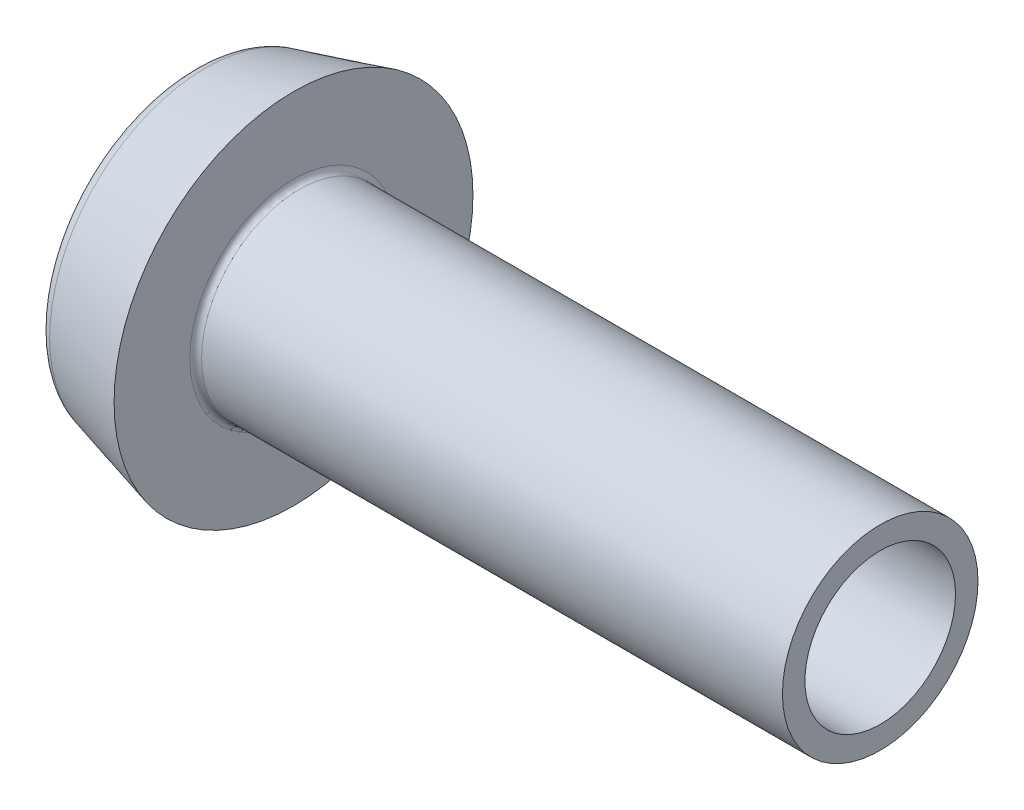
from build123d import *


with BuildPart() as part:
    # Sketch1 → Base-Revolve (revolve)
    with BuildSketch(Plane.XY, mode=Mode.PRIVATE) as base_revolve_sk:
        with BuildLine():
            Line((35.24, 0), (35.24, 5))
            Line((35.24, 5), (5.54, 5))
            ThreePointArc((5.54, 5), (5.327867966, 5.087867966), (5.24, 5.3))
            Line((5.24, 5.3), (5.24, 9.175))
            Line((5.24, 9.175), (0.741180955, 7.96954507))
            ThreePointArc((0.741180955, 7.96954507), (0.20664666, 7.612380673), (0, 7.003619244))
            Line((0, 7.003619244), (0, 0))
            Line((0, 0), (35.24, 0))
        make_face()
    revolve(base_revolve_sk.sketch.rotate(Axis((-47.217039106, 0, 0), (1, 0, 0)), 90), axis=Axis((-47.217039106, 0, 0), (1, 0, 0)))

    # Sketch2 → Cut-Revolve1 (revolve, cut)
    with BuildSketch(Plane.XY, mode=Mode.PRIVATE) as cut_revolve1_sk:
        Polygon((35.24, 0), (35.24, 3.85), (25.61, 3.85), (22.812811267, 0), align=None)
    revolve(cut_revolve1_sk.sketch.rotate(Axis((1.356225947, 0, 0), (-1, 0, 0)), 90), axis=Axis((1.356225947, 0, 0), (-1, 0, 0)), mode=Mode.SUBTRACT)


solid = part.part
